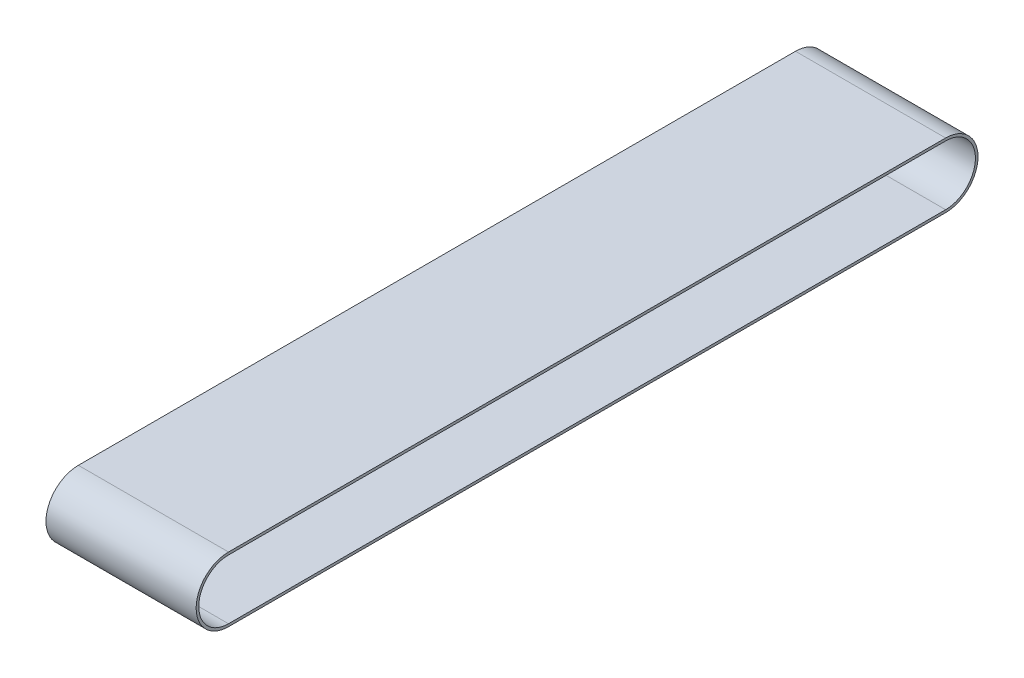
ISO-10303-21;
HEADER;
FILE_DESCRIPTION(('STEP AP214'),'2;1');
FILE_NAME('part.step','',(''),(''),'','','');
FILE_SCHEMA(('AUTOMOTIVE_DESIGN { 1 0 10303 214 1 1 1 1 }'));
ENDSEC;
DATA;
#1=APPLICATION_CONTEXT('core data for automotive mechanical design processes');
#2=APPLICATION_PROTOCOL_DEFINITION('international standard','automotive_design',2000,#1);
#3=PRODUCT_CONTEXT('',#1,'mechanical');
#4=PRODUCT('Part','Part','',(#3));
#5=PRODUCT_RELATED_PRODUCT_CATEGORY('part','',(#4));
#6=PRODUCT_DEFINITION_FORMATION('','',#4);
#7=PRODUCT_DEFINITION_CONTEXT('part definition',#1,'design');
#8=PRODUCT_DEFINITION('design','',#6,#7);
#9=PRODUCT_DEFINITION_SHAPE('','',#8);
#10=(LENGTH_UNIT() NAMED_UNIT(*) SI_UNIT(.MILLI.,.METRE.));
#11=(NAMED_UNIT(*) PLANE_ANGLE_UNIT() SI_UNIT($,.RADIAN.));
#12=(NAMED_UNIT(*) SI_UNIT($,.STERADIAN.) SOLID_ANGLE_UNIT());
#13=UNCERTAINTY_MEASURE_WITH_UNIT(LENGTH_MEASURE(1.E-05),#10,'distance_accuracy_value','');
#14=(GEOMETRIC_REPRESENTATION_CONTEXT(3) GLOBAL_UNCERTAINTY_ASSIGNED_CONTEXT((#13)) GLOBAL_UNIT_ASSIGNED_CONTEXT((#10,
#11,#12)) REPRESENTATION_CONTEXT('',''));
#15=CARTESIAN_POINT('',(0.,0.,0.));
#16=DIRECTION('',(0.,0.,1.));
#17=DIRECTION('',(1.,0.,0.));
#18=AXIS2_PLACEMENT_3D('',#15,#16,#17);
#19=CARTESIAN_POINT('',(2879.93929707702,0.,0.));
#20=DIRECTION('',(1.,0.,0.));
#21=DIRECTION('',(0.,0.,-1.));
#22=AXIS2_PLACEMENT_3D('',#19,#20,#21);
#23=CYLINDRICAL_SURFACE('',#22,62.5);
#24=CARTESIAN_POINT('',(3169.93929707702,0.,0.));
#25=DIRECTION('',(-1.,0.,0.));
#26=DIRECTION('',(0.,0.,1.));
#27=AXIS2_PLACEMENT_3D('',#24,#25,#26);
#28=CIRCLE('',#27,62.5);
#29=CARTESIAN_POINT('',(3169.93929707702,62.5,0.));
#30=VERTEX_POINT('',#29);
#31=CARTESIAN_POINT('',(3169.93929707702,-62.5,0.));
#32=VERTEX_POINT('',#31);
#33=EDGE_CURVE('E149',#30,#32,#28,.F.);
#34=ORIENTED_EDGE('',*,*,#33,.F.);
#35=DIRECTION('',(1.,0.,0.));
#36=VECTOR('',#35,1.);
#37=CARTESIAN_POINT('',(2879.93929707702,62.5,0.));
#38=LINE('',#37,#36);
#39=CARTESIAN_POINT('',(2879.93929707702,62.5,0.));
#40=VERTEX_POINT('',#39);
#41=EDGE_CURVE('E12',#40,#30,#38,.T.);
#42=ORIENTED_EDGE('',*,*,#41,.F.);
#43=CARTESIAN_POINT('',(2879.93929707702,0.,0.));
#44=DIRECTION('',(-1.,0.,0.));
#45=DIRECTION('',(0.,0.,1.));
#46=AXIS2_PLACEMENT_3D('',#43,#44,#45);
#47=CIRCLE('',#46,62.5);
#48=CARTESIAN_POINT('',(2879.93929707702,-62.5,0.));
#49=VERTEX_POINT('',#48);
#50=EDGE_CURVE('E163',#40,#49,#47,.F.);
#51=ORIENTED_EDGE('',*,*,#50,.T.);
#52=DIRECTION('',(1.,0.,0.));
#53=VECTOR('',#52,1.);
#54=CARTESIAN_POINT('',(2879.93929707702,-62.5,0.));
#55=LINE('',#54,#53);
#56=EDGE_CURVE('E53',#49,#32,#55,.T.);
#57=ORIENTED_EDGE('',*,*,#56,.T.);
#58=EDGE_LOOP('',(#34,#42,#51,#57));
#59=FACE_BOUND('',#58,.T.);
#60=ADVANCED_FACE('F50',(#59),#23,.T.);
#61=CARTESIAN_POINT('',(2879.93929707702,62.5,0.));
#62=DIRECTION('',(0.,1.,0.));
#63=DIRECTION('',(0.,0.,1.));
#64=AXIS2_PLACEMENT_3D('',#61,#62,#63);
#65=PLANE('',#64);
#66=DIRECTION('',(0.,0.,1.));
#67=VECTOR('',#66,1.);
#68=CARTESIAN_POINT('',(3169.93929707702,62.5,0.));
#69=LINE('',#68,#67);
#70=CARTESIAN_POINT('',(3169.93929707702,62.5,-1385.));
#71=VERTEX_POINT('',#70);
#72=EDGE_CURVE('E160',#71,#30,#69,.T.);
#73=ORIENTED_EDGE('',*,*,#72,.F.);
#74=DIRECTION('',(1.,0.,0.));
#75=VECTOR('',#74,1.);
#76=CARTESIAN_POINT('',(2879.93929707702,62.5,-1385.));
#77=LINE('',#76,#75);
#78=CARTESIAN_POINT('',(2879.93929707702,62.5,-1385.));
#79=VERTEX_POINT('',#78);
#80=EDGE_CURVE('E58',#79,#71,#77,.T.);
#81=ORIENTED_EDGE('',*,*,#80,.F.);
#82=DIRECTION('',(0.,0.,1.));
#83=VECTOR('',#82,1.);
#84=CARTESIAN_POINT('',(2879.93929707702,62.5,0.));
#85=LINE('',#84,#83);
#86=EDGE_CURVE('E172',#79,#40,#85,.T.);
#87=ORIENTED_EDGE('',*,*,#86,.T.);
#88=ORIENTED_EDGE('',*,*,#41,.T.);
#89=EDGE_LOOP('',(#73,#81,#87,#88));
#90=FACE_BOUND('',#89,.T.);
#91=ADVANCED_FACE('F186',(#90),#65,.T.);
#92=CARTESIAN_POINT('',(2879.93929707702,0.,-1385.));
#93=DIRECTION('',(1.,0.,0.));
#94=DIRECTION('',(0.,0.,-1.));
#95=AXIS2_PLACEMENT_3D('',#92,#93,#94);
#96=CYLINDRICAL_SURFACE('',#95,62.5);
#97=CARTESIAN_POINT('',(3169.93929707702,0.,-1385.));
#98=DIRECTION('',(-1.,0.,0.));
#99=DIRECTION('',(0.,0.,1.));
#100=AXIS2_PLACEMENT_3D('',#97,#98,#99);
#101=CIRCLE('',#100,62.5);
#102=CARTESIAN_POINT('',(3169.93929707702,-62.5,-1385.));
#103=VERTEX_POINT('',#102);
#104=EDGE_CURVE('E157',#103,#71,#101,.F.);
#105=ORIENTED_EDGE('',*,*,#104,.F.);
#106=DIRECTION('',(1.,0.,0.));
#107=VECTOR('',#106,1.);
#108=CARTESIAN_POINT('',(2879.93929707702,-62.5,-1385.));
#109=LINE('',#108,#107);
#110=CARTESIAN_POINT('',(2879.93929707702,-62.5,-1385.));
#111=VERTEX_POINT('',#110);
#112=EDGE_CURVE('E175',#111,#103,#109,.T.);
#113=ORIENTED_EDGE('',*,*,#112,.F.);
#114=CARTESIAN_POINT('',(2879.93929707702,0.,-1385.));
#115=DIRECTION('',(-1.,0.,0.));
#116=DIRECTION('',(0.,0.,1.));
#117=AXIS2_PLACEMENT_3D('',#114,#115,#116);
#118=CIRCLE('',#117,62.5);
#119=EDGE_CURVE('E169',#111,#79,#118,.F.);
#120=ORIENTED_EDGE('',*,*,#119,.T.);
#121=ORIENTED_EDGE('',*,*,#80,.T.);
#122=EDGE_LOOP('',(#105,#113,#120,#121));
#123=FACE_BOUND('',#122,.T.);
#124=ADVANCED_FACE('F192',(#123),#96,.T.);
#125=CARTESIAN_POINT('',(2879.93929707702,-62.5,0.));
#126=DIRECTION('',(0.,-1.,0.));
#127=DIRECTION('',(0.,0.,-1.));
#128=AXIS2_PLACEMENT_3D('',#125,#126,#127);
#129=PLANE('',#128);
#130=DIRECTION('',(0.,0.,-1.));
#131=VECTOR('',#130,1.);
#132=CARTESIAN_POINT('',(3169.93929707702,-62.5,0.));
#133=LINE('',#132,#131);
#134=EDGE_CURVE('E154',#32,#103,#133,.T.);
#135=ORIENTED_EDGE('',*,*,#134,.F.);
#136=ORIENTED_EDGE('',*,*,#56,.F.);
#137=DIRECTION('',(0.,0.,-1.));
#138=VECTOR('',#137,1.);
#139=CARTESIAN_POINT('',(2879.93929707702,-62.5,0.));
#140=LINE('',#139,#138);
#141=EDGE_CURVE('E166',#49,#111,#140,.T.);
#142=ORIENTED_EDGE('',*,*,#141,.T.);
#143=ORIENTED_EDGE('',*,*,#112,.T.);
#144=EDGE_LOOP('',(#135,#136,#142,#143));
#145=FACE_BOUND('',#144,.T.);
#146=ADVANCED_FACE('F183',(#145),#129,.T.);
#147=CARTESIAN_POINT('',(2879.93929707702,0.,0.));
#148=DIRECTION('',(-1.,0.,0.));
#149=DIRECTION('',(0.,0.,1.));
#150=AXIS2_PLACEMENT_3D('',#147,#148,#149);
#151=PLANE('',#150);
#152=CARTESIAN_POINT('',(2879.93929707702,0.,0.));
#153=DIRECTION('',(1.,0.,0.));
#154=DIRECTION('',(0.,0.,1.));
#155=AXIS2_PLACEMENT_3D('',#152,#153,#154);
#156=CIRCLE('',#155,57.5);
#157=CARTESIAN_POINT('',(2879.93929707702,57.5,0.));
#158=VERTEX_POINT('',#157);
#159=CARTESIAN_POINT('',(2879.93929707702,-57.5,0.));
#160=VERTEX_POINT('',#159);
#161=EDGE_CURVE('E135',#158,#160,#156,.T.);
#162=ORIENTED_EDGE('',*,*,#161,.T.);
#163=DIRECTION('',(0.,0.,-1.));
#164=VECTOR('',#163,1.);
#165=CARTESIAN_POINT('',(2879.93929707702,-57.5,0.));
#166=LINE('',#165,#164);
#167=CARTESIAN_POINT('',(2879.93929707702,-57.5,-1385.));
#168=VERTEX_POINT('',#167);
#169=EDGE_CURVE('E141',#160,#168,#166,.T.);
#170=ORIENTED_EDGE('',*,*,#169,.T.);
#171=CARTESIAN_POINT('',(2879.93929707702,0.,-1385.));
#172=DIRECTION('',(1.,0.,0.));
#173=DIRECTION('',(0.,0.,-1.));
#174=AXIS2_PLACEMENT_3D('',#171,#172,#173);
#175=CIRCLE('',#174,57.5);
#176=CARTESIAN_POINT('',(2879.93929707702,57.5,-1385.));
#177=VERTEX_POINT('',#176);
#178=EDGE_CURVE('E66',#168,#177,#175,.T.);
#179=ORIENTED_EDGE('',*,*,#178,.T.);
#180=DIRECTION('',(0.,0.,1.));
#181=VECTOR('',#180,1.);
#182=CARTESIAN_POINT('',(2879.93929707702,57.5,0.));
#183=LINE('',#182,#181);
#184=EDGE_CURVE('E144',#177,#158,#183,.T.);
#185=ORIENTED_EDGE('',*,*,#184,.T.);
#186=EDGE_LOOP('',(#162,#170,#179,#185));
#187=FACE_BOUND('',#186,.T.);
#188=ORIENTED_EDGE('',*,*,#50,.F.);
#189=ORIENTED_EDGE('',*,*,#86,.F.);
#190=ORIENTED_EDGE('',*,*,#119,.F.);
#191=ORIENTED_EDGE('',*,*,#141,.F.);
#192=EDGE_LOOP('',(#188,#189,#190,#191));
#193=FACE_BOUND('',#192,.T.);
#194=ADVANCED_FACE('F189',(#187,#193),#151,.T.);
#195=CARTESIAN_POINT('',(3169.93929707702,0.,0.));
#196=DIRECTION('',(-1.,0.,0.));
#197=DIRECTION('',(0.,0.,1.));
#198=AXIS2_PLACEMENT_3D('',#195,#196,#197);
#199=PLANE('',#198);
#200=DIRECTION('',(0.,0.,-1.));
#201=VECTOR('',#200,1.);
#202=CARTESIAN_POINT('',(3169.93929707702,-57.5,0.));
#203=LINE('',#202,#201);
#204=CARTESIAN_POINT('',(3169.93929707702,-57.5,0.));
#205=VERTEX_POINT('',#204);
#206=CARTESIAN_POINT('',(3169.93929707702,-57.5,-1385.));
#207=VERTEX_POINT('',#206);
#208=EDGE_CURVE('E126',#205,#207,#203,.T.);
#209=ORIENTED_EDGE('',*,*,#208,.F.);
#210=CARTESIAN_POINT('',(3169.93929707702,0.,0.));
#211=DIRECTION('',(1.,0.,0.));
#212=DIRECTION('',(0.,0.,1.));
#213=AXIS2_PLACEMENT_3D('',#210,#211,#212);
#214=CIRCLE('',#213,57.5);
#215=CARTESIAN_POINT('',(3169.93929707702,57.5,0.));
#216=VERTEX_POINT('',#215);
#217=EDGE_CURVE('E74',#216,#205,#214,.T.);
#218=ORIENTED_EDGE('',*,*,#217,.F.);
#219=DIRECTION('',(0.,0.,1.));
#220=VECTOR('',#219,1.);
#221=CARTESIAN_POINT('',(3169.93929707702,57.5,0.));
#222=LINE('',#221,#220);
#223=CARTESIAN_POINT('',(3169.93929707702,57.5,-1385.));
#224=VERTEX_POINT('',#223);
#225=EDGE_CURVE('E133',#224,#216,#222,.T.);
#226=ORIENTED_EDGE('',*,*,#225,.F.);
#227=CARTESIAN_POINT('',(3169.93929707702,0.,-1385.));
#228=DIRECTION('',(1.,0.,0.));
#229=DIRECTION('',(0.,0.,-1.));
#230=AXIS2_PLACEMENT_3D('',#227,#228,#229);
#231=CIRCLE('',#230,57.5);
#232=EDGE_CURVE('E117',#207,#224,#231,.T.);
#233=ORIENTED_EDGE('',*,*,#232,.F.);
#234=EDGE_LOOP('',(#209,#218,#226,#233));
#235=FACE_BOUND('',#234,.T.);
#236=ORIENTED_EDGE('',*,*,#33,.T.);
#237=ORIENTED_EDGE('',*,*,#134,.T.);
#238=ORIENTED_EDGE('',*,*,#104,.T.);
#239=ORIENTED_EDGE('',*,*,#72,.T.);
#240=EDGE_LOOP('',(#236,#237,#238,#239));
#241=FACE_BOUND('',#240,.T.);
#242=ADVANCED_FACE('F130',(#235,#241),#199,.F.);
#243=CARTESIAN_POINT('',(2879.93929707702,0.,0.));
#244=DIRECTION('',(1.,0.,0.));
#245=DIRECTION('',(0.,0.,-1.));
#246=AXIS2_PLACEMENT_3D('',#243,#244,#245);
#247=CYLINDRICAL_SURFACE('',#246,57.5);
#248=ORIENTED_EDGE('',*,*,#217,.T.);
#249=DIRECTION('',(1.,0.,0.));
#250=VECTOR('',#249,1.);
#251=CARTESIAN_POINT('',(2879.93929707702,-57.5,0.));
#252=LINE('',#251,#250);
#253=EDGE_CURVE('E123',#160,#205,#252,.T.);
#254=ORIENTED_EDGE('',*,*,#253,.F.);
#255=ORIENTED_EDGE('',*,*,#161,.F.);
#256=DIRECTION('',(1.,0.,0.));
#257=VECTOR('',#256,1.);
#258=CARTESIAN_POINT('',(2879.93929707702,57.5,0.));
#259=LINE('',#258,#257);
#260=EDGE_CURVE('E147',#158,#216,#259,.T.);
#261=ORIENTED_EDGE('',*,*,#260,.T.);
#262=EDGE_LOOP('',(#248,#254,#255,#261));
#263=FACE_BOUND('',#262,.T.);
#264=ADVANCED_FACE('F227',(#263),#247,.F.);
#265=CARTESIAN_POINT('',(2879.93929707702,57.5,0.));
#266=DIRECTION('',(0.,1.,0.));
#267=DIRECTION('',(0.,0.,1.));
#268=AXIS2_PLACEMENT_3D('',#265,#266,#267);
#269=PLANE('',#268);
#270=ORIENTED_EDGE('',*,*,#225,.T.);
#271=ORIENTED_EDGE('',*,*,#260,.F.);
#272=ORIENTED_EDGE('',*,*,#184,.F.);
#273=DIRECTION('',(1.,0.,0.));
#274=VECTOR('',#273,1.);
#275=CARTESIAN_POINT('',(2879.93929707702,57.5,-1385.));
#276=LINE('',#275,#274);
#277=EDGE_CURVE('E122',#177,#224,#276,.T.);
#278=ORIENTED_EDGE('',*,*,#277,.T.);
#279=EDGE_LOOP('',(#270,#271,#272,#278));
#280=FACE_BOUND('',#279,.T.);
#281=ADVANCED_FACE('F234',(#280),#269,.F.);
#282=CARTESIAN_POINT('',(2879.93929707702,0.,-1385.));
#283=DIRECTION('',(1.,0.,0.));
#284=DIRECTION('',(0.,0.,-1.));
#285=AXIS2_PLACEMENT_3D('',#282,#283,#284);
#286=CYLINDRICAL_SURFACE('',#285,57.5);
#287=ORIENTED_EDGE('',*,*,#232,.T.);
#288=ORIENTED_EDGE('',*,*,#277,.F.);
#289=ORIENTED_EDGE('',*,*,#178,.F.);
#290=DIRECTION('',(1.,0.,0.));
#291=VECTOR('',#290,1.);
#292=CARTESIAN_POINT('',(2879.93929707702,-57.5,-1385.));
#293=LINE('',#292,#291);
#294=EDGE_CURVE('E113',#168,#207,#293,.T.);
#295=ORIENTED_EDGE('',*,*,#294,.T.);
#296=EDGE_LOOP('',(#287,#288,#289,#295));
#297=FACE_BOUND('',#296,.T.);
#298=ADVANCED_FACE('F115',(#297),#286,.F.);
#299=CARTESIAN_POINT('',(2879.93929707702,-57.5,0.));
#300=DIRECTION('',(0.,-1.,0.));
#301=DIRECTION('',(0.,0.,-1.));
#302=AXIS2_PLACEMENT_3D('',#299,#300,#301);
#303=PLANE('',#302);
#304=ORIENTED_EDGE('',*,*,#208,.T.);
#305=ORIENTED_EDGE('',*,*,#294,.F.);
#306=ORIENTED_EDGE('',*,*,#169,.F.);
#307=ORIENTED_EDGE('',*,*,#253,.T.);
#308=EDGE_LOOP('',(#304,#305,#306,#307));
#309=FACE_BOUND('',#308,.T.);
#310=ADVANCED_FACE('F127',(#309),#303,.F.);
#311=CLOSED_SHELL('',(#60,#91,#124,#146,#194,#242,#264,#281,#298,#310));
#312=MANIFOLD_SOLID_BREP('B2',#311);
#313=ADVANCED_BREP_SHAPE_REPRESENTATION('',(#18,#312),#14);
#314=SHAPE_DEFINITION_REPRESENTATION(#9,#313);
ENDSEC;
END-ISO-10303-21;
